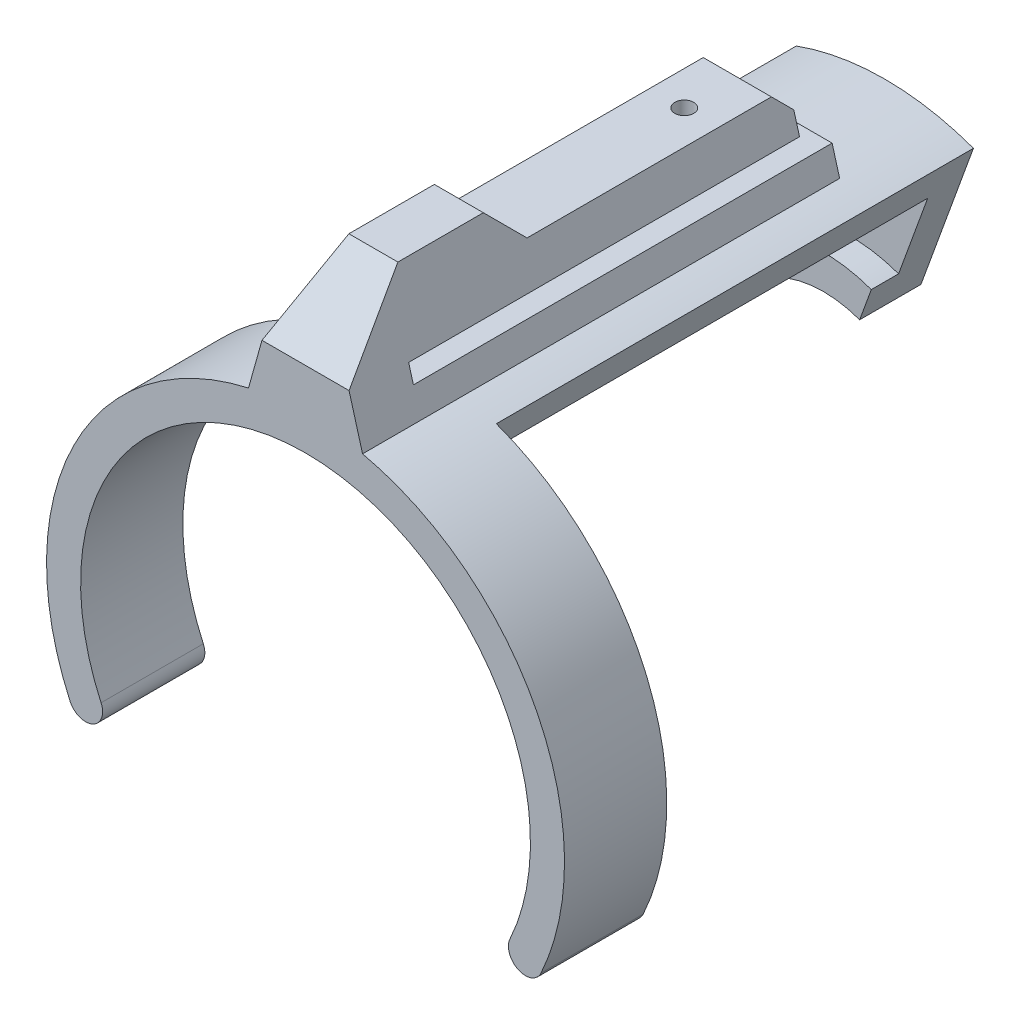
ISO-10303-21;
HEADER;
FILE_DESCRIPTION(('STEP AP214'),'2;1');
FILE_NAME('part.step','',(''),(''),'','','');
FILE_SCHEMA(('AUTOMOTIVE_DESIGN { 1 0 10303 214 1 1 1 1 }'));
ENDSEC;
DATA;
#1=APPLICATION_CONTEXT('core data for automotive mechanical design processes');
#2=APPLICATION_PROTOCOL_DEFINITION('international standard','automotive_design',2000,#1);
#3=PRODUCT_CONTEXT('',#1,'mechanical');
#4=PRODUCT('Part','Part','',(#3));
#5=PRODUCT_RELATED_PRODUCT_CATEGORY('part','',(#4));
#6=PRODUCT_DEFINITION_FORMATION('','',#4);
#7=PRODUCT_DEFINITION_CONTEXT('part definition',#1,'design');
#8=PRODUCT_DEFINITION('design','',#6,#7);
#9=PRODUCT_DEFINITION_SHAPE('','',#8);
#10=(LENGTH_UNIT() NAMED_UNIT(*) SI_UNIT(.MILLI.,.METRE.));
#11=(NAMED_UNIT(*) PLANE_ANGLE_UNIT() SI_UNIT($,.RADIAN.));
#12=(NAMED_UNIT(*) SI_UNIT($,.STERADIAN.) SOLID_ANGLE_UNIT());
#13=UNCERTAINTY_MEASURE_WITH_UNIT(LENGTH_MEASURE(1.E-05),#10,'distance_accuracy_value','');
#14=(GEOMETRIC_REPRESENTATION_CONTEXT(3) GLOBAL_UNCERTAINTY_ASSIGNED_CONTEXT((#13)) GLOBAL_UNIT_ASSIGNED_CONTEXT((#10,
#11,#12)) REPRESENTATION_CONTEXT('',''));
#15=CARTESIAN_POINT('',(0.,0.,0.));
#16=DIRECTION('',(0.,0.,1.));
#17=DIRECTION('',(1.,0.,0.));
#18=AXIS2_PLACEMENT_3D('',#15,#16,#17);
#19=CARTESIAN_POINT('',(-5.,49.0673507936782,-55.));
#20=DIRECTION('',(0.,-1.,0.));
#21=DIRECTION('',(0.,0.,-1.));
#22=AXIS2_PLACEMENT_3D('',#19,#20,#21);
#23=PLANE('',#22);
#24=CARTESIAN_POINT('',(0.,49.0673507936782,-40.5675951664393));
#25=DIRECTION('',(0.,1.,0.));
#26=DIRECTION('',(0.,0.,1.));
#27=AXIS2_PLACEMENT_3D('',#24,#25,#26);
#28=CIRCLE('',#27,1.4);
#29=CARTESIAN_POINT('',(0.,49.0673507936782,-39.1675951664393));
#30=VERTEX_POINT('',#29);
#31=EDGE_CURVE('E240',#30,#30,#28,.T.);
#32=ORIENTED_EDGE('',*,*,#31,.F.);
#33=EDGE_LOOP('',(#32));
#34=FACE_BOUND('',#33,.T.);
#35=DIRECTION('',(-1.,0.,0.));
#36=VECTOR('',#35,1.);
#37=CARTESIAN_POINT('',(34.7913742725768,49.0673507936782,-12.5028492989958));
#38=LINE('',#37,#36);
#39=CARTESIAN_POINT('',(5.,49.0673507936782,-12.5028492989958));
#40=VERTEX_POINT('',#39);
#41=CARTESIAN_POINT('',(-5.,49.0673507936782,-12.5028492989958));
#42=VERTEX_POINT('',#41);
#43=EDGE_CURVE('E57',#40,#42,#38,.T.);
#44=ORIENTED_EDGE('',*,*,#43,.F.);
#45=DIRECTION('',(0.,0.,1.));
#46=VECTOR('',#45,1.);
#47=CARTESIAN_POINT('',(5.,49.0673507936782,-55.));
#48=LINE('',#47,#46);
#49=CARTESIAN_POINT('',(5.,49.0673507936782,-48.3523226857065));
#50=VERTEX_POINT('',#49);
#51=EDGE_CURVE('E290',#50,#40,#48,.T.);
#52=ORIENTED_EDGE('',*,*,#51,.F.);
#53=DIRECTION('',(-1.,0.,0.));
#54=VECTOR('',#53,1.);
#55=CARTESIAN_POINT('',(-5.,49.0673507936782,-48.3523226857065));
#56=LINE('',#55,#54);
#57=CARTESIAN_POINT('',(-5.,49.0673507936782,-48.3523226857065));
#58=VERTEX_POINT('',#57);
#59=EDGE_CURVE('E259',#50,#58,#56,.T.);
#60=ORIENTED_EDGE('',*,*,#59,.T.);
#61=DIRECTION('',(0.,0.,1.));
#62=VECTOR('',#61,1.);
#63=CARTESIAN_POINT('',(-5.,49.0673507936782,-55.));
#64=LINE('',#63,#62);
#65=EDGE_CURVE('E53',#58,#42,#64,.T.);
#66=ORIENTED_EDGE('',*,*,#65,.T.);
#67=EDGE_LOOP('',(#44,#52,#60,#66));
#68=FACE_BOUND('',#67,.T.);
#69=ADVANCED_FACE('F33',(#34,#68),#23,.F.);
#70=CARTESIAN_POINT('',(0.,0.,15.));
#71=DIRECTION('',(0.,0.,-1.));
#72=DIRECTION('',(-1.,0.,0.));
#73=AXIS2_PLACEMENT_3D('',#70,#71,#72);
#74=CYLINDRICAL_SURFACE('',#73,33.);
#75=CARTESIAN_POINT('',(0.,0.,0.));
#76=DIRECTION('',(0.,0.,-1.));
#77=DIRECTION('',(-1.,0.,0.));
#78=AXIS2_PLACEMENT_3D('',#75,#76,#77);
#79=CIRCLE('',#78,33.);
#80=CARTESIAN_POINT('',(-30.,-13.7477270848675,0.));
#81=VERTEX_POINT('',#80);
#82=CARTESIAN_POINT('',(-11.2866647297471,31.009856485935,0.));
#83=VERTEX_POINT('',#82);
#84=EDGE_CURVE('E362',#81,#83,#79,.T.);
#85=ORIENTED_EDGE('',*,*,#84,.T.);
#86=DIRECTION('',(0.,0.,-1.));
#87=VECTOR('',#86,1.);
#88=CARTESIAN_POINT('',(-11.2866647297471,31.009856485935,-65.));
#89=LINE('',#88,#87);
#90=CARTESIAN_POINT('',(-11.2866647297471,31.009856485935,-65.));
#91=VERTEX_POINT('',#90);
#92=EDGE_CURVE('E293',#83,#91,#89,.T.);
#93=ORIENTED_EDGE('',*,*,#92,.T.);
#94=CARTESIAN_POINT('',(0.,0.,-65.));
#95=DIRECTION('',(0.,0.,1.));
#96=DIRECTION('',(1.,0.,0.));
#97=AXIS2_PLACEMENT_3D('',#94,#95,#96);
#98=CIRCLE('',#97,33.);
#99=CARTESIAN_POINT('',(11.2866647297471,31.009856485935,-65.));
#100=VERTEX_POINT('',#99);
#101=EDGE_CURVE('E332',#100,#91,#98,.T.);
#102=ORIENTED_EDGE('',*,*,#101,.F.);
#103=DIRECTION('',(0.,0.,-1.));
#104=VECTOR('',#103,1.);
#105=CARTESIAN_POINT('',(11.2866647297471,31.009856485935,-65.));
#106=LINE('',#105,#104);
#107=CARTESIAN_POINT('',(11.2866647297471,31.009856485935,0.));
#108=VERTEX_POINT('',#107);
#109=EDGE_CURVE('E313',#108,#100,#106,.T.);
#110=ORIENTED_EDGE('',*,*,#109,.F.);
#111=CARTESIAN_POINT('',(30.,-13.7477270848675,0.));
#112=VERTEX_POINT('',#111);
#113=EDGE_CURVE('E361',#108,#112,#79,.T.);
#114=ORIENTED_EDGE('',*,*,#113,.T.);
#115=DIRECTION('',(0.,0.,-1.));
#116=VECTOR('',#115,1.);
#117=CARTESIAN_POINT('',(30.,-13.7477270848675,15.));
#118=LINE('',#117,#116);
#119=CARTESIAN_POINT('',(30.,-13.7477270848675,15.));
#120=VERTEX_POINT('',#119);
#121=EDGE_CURVE('E375',#120,#112,#118,.T.);
#122=ORIENTED_EDGE('',*,*,#121,.F.);
#123=CARTESIAN_POINT('',(0.,0.,15.));
#124=DIRECTION('',(0.,0.,-1.));
#125=DIRECTION('',(-1.,0.,0.));
#126=AXIS2_PLACEMENT_3D('',#123,#124,#125);
#127=CIRCLE('',#126,33.);
#128=CARTESIAN_POINT('',(-30.,-13.7477270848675,15.));
#129=VERTEX_POINT('',#128);
#130=EDGE_CURVE('E349',#129,#120,#127,.T.);
#131=ORIENTED_EDGE('',*,*,#130,.F.);
#132=DIRECTION('',(0.,0.,-1.));
#133=VECTOR('',#132,1.);
#134=CARTESIAN_POINT('',(-30.,-13.7477270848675,15.));
#135=LINE('',#134,#133);
#136=EDGE_CURVE('E378',#129,#81,#135,.T.);
#137=ORIENTED_EDGE('',*,*,#136,.T.);
#138=EDGE_LOOP('',(#85,#93,#102,#110,#114,#122,#131,#137));
#139=FACE_BOUND('',#138,.T.);
#140=CARTESIAN_POINT('',(0.,33.,-43.5675951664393));
#141=CARTESIAN_POINT('',(0.168138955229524,32.9999982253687,-43.5675878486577));
#142=CARTESIAN_POINT('',(0.33639094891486,32.998701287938,-43.5534122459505));
#143=CARTESIAN_POINT('',(0.668235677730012,32.9936522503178,-43.4970739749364));
#144=CARTESIAN_POINT('',(0.831822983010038,32.9898974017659,-43.4548799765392));
#145=CARTESIAN_POINT('',(1.14948445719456,32.9803566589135,-43.3437387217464));
#146=CARTESIAN_POINT('',(1.30356410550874,32.9745719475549,-43.2748070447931));
#147=CARTESIAN_POINT('',(1.59793078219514,32.9616193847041,-43.1121760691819));
#148=CARTESIAN_POINT('',(1.73822066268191,32.9544518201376,-43.0184819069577));
#149=CARTESIAN_POINT('',(2.00148223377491,32.9395131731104,-42.8086826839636));
#150=CARTESIAN_POINT('',(2.12440675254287,32.9317405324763,-42.6925185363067));
#151=CARTESIAN_POINT('',(2.34904315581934,32.91648074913,-42.4412022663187));
#152=CARTESIAN_POINT('',(2.45075408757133,32.908993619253,-42.3060492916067));
#153=CARTESIAN_POINT('',(2.63023932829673,32.8951362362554,-42.0203016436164));
#154=CARTESIAN_POINT('',(2.70797159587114,32.8887679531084,-41.8696804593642));
#155=CARTESIAN_POINT('',(2.8370244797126,32.8778878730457,-41.5574563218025));
#156=CARTESIAN_POINT('',(2.88834564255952,32.8733760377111,-41.3958535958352));
#157=CARTESIAN_POINT('',(2.96298122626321,32.8667332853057,-41.0667304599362));
#158=CARTESIAN_POINT('',(2.98637317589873,32.8645957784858,-40.8992277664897));
#159=CARTESIAN_POINT('',(3.00472589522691,32.862923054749,-40.5626610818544));
#160=CARTESIAN_POINT('',(2.99968729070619,32.8633877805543,-40.3935971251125));
#161=CARTESIAN_POINT('',(2.96138592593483,32.8668610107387,-40.0592396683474));
#162=CARTESIAN_POINT('',(2.9282075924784,32.8698619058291,-39.8939364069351));
#163=CARTESIAN_POINT('',(2.83469983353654,32.8780574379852,-39.5712545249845));
#164=CARTESIAN_POINT('',(2.7743700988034,32.8832521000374,-39.4138759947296));
#165=CARTESIAN_POINT('',(2.62817812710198,32.8952586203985,-39.111242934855));
#166=CARTESIAN_POINT('',(2.54227819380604,32.9020728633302,-38.9660067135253));
#167=CARTESIAN_POINT('',(2.34741134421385,32.9165486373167,-38.6919812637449));
#168=CARTESIAN_POINT('',(2.23844387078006,32.9242101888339,-38.5631924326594));
#169=CARTESIAN_POINT('',(2.00006245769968,32.9395511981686,-38.325226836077));
#170=CARTESIAN_POINT('',(1.87057556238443,32.9472306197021,-38.2161231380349));
#171=CARTESIAN_POINT('',(1.59508496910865,32.9617156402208,-38.0211904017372));
#172=CARTESIAN_POINT('',(1.44908125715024,32.9685212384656,-37.935361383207));
#173=CARTESIAN_POINT('',(1.14465269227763,32.980493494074,-37.7894182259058));
#174=CARTESIAN_POINT('',(0.986226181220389,32.9856599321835,-37.729307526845));
#175=CARTESIAN_POINT('',(0.661471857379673,32.9937693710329,-37.6365595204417));
#176=CARTESIAN_POINT('',(0.495144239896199,32.9967124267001,-37.6039215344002));
#177=CARTESIAN_POINT('',(0.159942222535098,33.0000364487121,-37.5671375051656));
#178=CARTESIAN_POINT('',(-0.00892102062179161,33.0004264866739,-37.5628905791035));
#179=CARTESIAN_POINT('',(-0.344956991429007,32.9986247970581,-37.5827446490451));
#180=CARTESIAN_POINT('',(-0.512129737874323,32.9964330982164,-37.6068453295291));
#181=CARTESIAN_POINT('',(-0.839750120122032,32.98972015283,-37.6826268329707));
#182=CARTESIAN_POINT('',(-1.00020870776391,32.985202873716,-37.7342606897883));
#183=CARTESIAN_POINT('',(-1.31018569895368,32.9743459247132,-37.8635947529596));
#184=CARTESIAN_POINT('',(-1.45970389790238,32.9680062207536,-37.9412954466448));
#185=CARTESIAN_POINT('',(-1.74401365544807,32.9541918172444,-38.1208096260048));
#186=CARTESIAN_POINT('',(-1.87876301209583,32.9467140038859,-38.2226897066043));
#187=CARTESIAN_POINT('',(-2.129283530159,32.9314733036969,-38.4475747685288));
#188=CARTESIAN_POINT('',(-2.24505429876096,32.92371041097,-38.5705801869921));
#189=CARTESIAN_POINT('',(-2.45467921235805,32.9087474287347,-38.8346630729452));
#190=CARTESIAN_POINT('',(-2.54846736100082,32.9015490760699,-38.9757930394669));
#191=CARTESIAN_POINT('',(-2.71101171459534,32.8885556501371,-39.2718585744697));
#192=CARTESIAN_POINT('',(-2.77976820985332,32.8827605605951,-39.4267939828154));
#193=CARTESIAN_POINT('',(-2.89018592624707,32.8732400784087,-39.7458418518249));
#194=CARTESIAN_POINT('',(-2.93188705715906,32.8695116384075,-39.909940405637));
#195=CARTESIAN_POINT('',(-2.98714005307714,32.8645367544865,-40.2428456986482));
#196=CARTESIAN_POINT('',(-3.00069257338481,32.8632902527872,-40.4116523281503));
#197=CARTESIAN_POINT('',(-2.99925542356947,32.8634213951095,-40.7485260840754));
#198=CARTESIAN_POINT('',(-2.9843694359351,32.8647895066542,-40.9165936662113));
#199=CARTESIAN_POINT('',(-2.92669454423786,32.8699754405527,-41.2478306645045));
#200=CARTESIAN_POINT('',(-2.88390560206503,32.8737932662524,-41.4110000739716));
#201=CARTESIAN_POINT('',(-2.77166673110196,32.8834458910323,-41.7278123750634));
#202=CARTESIAN_POINT('',(-2.70221919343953,32.8892805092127,-41.8814561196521));
#203=CARTESIAN_POINT('',(-2.53864562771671,32.9023096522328,-42.1749216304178));
#204=CARTESIAN_POINT('',(-2.4445198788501,32.9095041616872,-42.3147435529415));
#205=CARTESIAN_POINT('',(-2.23387195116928,32.9244737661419,-42.5771275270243));
#206=CARTESIAN_POINT('',(-2.11727272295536,32.9322508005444,-42.6996276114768));
#207=CARTESIAN_POINT('',(-1.8651341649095,32.9474914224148,-42.9233723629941));
#208=CARTESIAN_POINT('',(-1.72959027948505,32.9549549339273,-43.0246119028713));
#209=CARTESIAN_POINT('',(-1.44310097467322,32.9687436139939,-43.2031249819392));
#210=CARTESIAN_POINT('',(-1.29212319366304,32.9750663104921,-43.2803467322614));
#211=CARTESIAN_POINT('',(-0.979386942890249,32.9858330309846,-43.4082427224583));
#212=CARTESIAN_POINT('',(-0.817641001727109,32.9902791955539,-43.4589472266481));
#213=CARTESIAN_POINT('',(-0.545797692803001,32.9956609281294,-43.5195724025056));
#214=CARTESIAN_POINT('',(-0.437444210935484,32.9972805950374,-43.5375567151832));
#215=CARTESIAN_POINT('',(-0.219409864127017,32.9994507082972,-43.5615704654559));
#216=CARTESIAN_POINT('',(-0.109729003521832,33.0000011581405,-43.5675999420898));
#217=CARTESIAN_POINT('',(0.,33.,-43.5675951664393));
#218=B_SPLINE_CURVE_WITH_KNOTS('',3,(#140,#141,#142,#143,#144,#145,#146,#147,#148,#149,#150,
#151,#152,#153,#154,#155,#156,#157,#158,#159,#160,#161,#162,#163,#164,#165,#166,#167,#168,#169,
#170,#171,#172,#173,#174,#175,#176,#177,#178,#179,#180,#181,#182,#183,#184,#185,#186,#187,#188,
#189,#190,#191,#192,#193,#194,#195,#196,#197,#198,#199,#200,#201,#202,#203,#204,#205,#206,#207,
#208,#209,#210,#211,#212,#213,#214,#215,#216,#217),.UNSPECIFIED.,.T.,.F.,(4,2,2,2,2,2,2,2,2,2,2,
2,2,2,2,2,2,2,2,2,2,2,2,2,2,2,2,2,2,2,2,2,2,2,2,2,2,2,4),(0.,0.504016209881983,1.00859696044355,
1.51288414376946,2.01706680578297,2.52259374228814,3.02814337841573,3.53457441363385,
4.04099496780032,4.54600645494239,5.0510068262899,5.55449739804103,6.05799370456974,
6.56223598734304,7.0664904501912,7.57257974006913,8.07866945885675,8.58482684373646,
9.09097172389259,9.59531714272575,10.0996569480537,10.6031391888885,11.1066308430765,
11.6115256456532,12.1164308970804,12.6228330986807,13.1292294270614,13.6348770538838,
14.1405129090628,14.6443088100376,15.1481053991,15.6518568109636,16.1556025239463,
16.6611070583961,17.1667333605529,17.6734424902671,18.1795720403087,18.5084986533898,
18.8374241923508),.UNSPECIFIED.);
#219=CARTESIAN_POINT('',(0.,33.,-43.5675951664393));
#220=VERTEX_POINT('',#219);
#221=EDGE_CURVE('E37',#220,#220,#218,.T.);
#222=ORIENTED_EDGE('',*,*,#221,.F.);
#223=EDGE_LOOP('',(#222));
#224=FACE_BOUND('',#223,.T.);
#225=ADVANCED_FACE('F409',(#139,#224),#74,.F.);
#226=CARTESIAN_POINT('',(0.,0.,15.));
#227=DIRECTION('',(0.,0.,-1.));
#228=DIRECTION('',(-1.,0.,0.));
#229=AXIS2_PLACEMENT_3D('',#226,#227,#228);
#230=CYLINDRICAL_SURFACE('',#229,38.);
#231=DIRECTION('',(0.,0.,1.));
#232=VECTOR('',#231,1.);
#233=CARTESIAN_POINT('',(8.36728780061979,37.0673507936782,-55.));
#234=LINE('',#233,#232);
#235=CARTESIAN_POINT('',(8.36728780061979,37.0673507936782,-55.));
#236=VERTEX_POINT('',#235);
#237=CARTESIAN_POINT('',(8.36728780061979,37.0673507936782,15.));
#238=VERTEX_POINT('',#237);
#239=EDGE_CURVE('E287',#236,#238,#234,.T.);
#240=ORIENTED_EDGE('',*,*,#239,.T.);
#241=CARTESIAN_POINT('',(0.,0.,15.));
#242=DIRECTION('',(0.,0.,1.));
#243=DIRECTION('',(-1.,0.,0.));
#244=AXIS2_PLACEMENT_3D('',#241,#242,#243);
#245=CIRCLE('',#244,38.);
#246=CARTESIAN_POINT('',(34.5454545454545,-15.8307160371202,15.));
#247=VERTEX_POINT('',#246);
#248=EDGE_CURVE('E355',#247,#238,#245,.T.);
#249=ORIENTED_EDGE('',*,*,#248,.F.);
#250=DIRECTION('',(0.,0.,-1.));
#251=VECTOR('',#250,1.);
#252=CARTESIAN_POINT('',(34.5454545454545,-15.8307160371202,15.));
#253=LINE('',#252,#251);
#254=CARTESIAN_POINT('',(34.5454545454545,-15.8307160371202,0.));
#255=VERTEX_POINT('',#254);
#256=EDGE_CURVE('E372',#247,#255,#253,.T.);
#257=ORIENTED_EDGE('',*,*,#256,.T.);
#258=CARTESIAN_POINT('',(0.,0.,0.));
#259=DIRECTION('',(0.,0.,1.));
#260=DIRECTION('',(-1.,0.,0.));
#261=AXIS2_PLACEMENT_3D('',#258,#259,#260);
#262=CIRCLE('',#261,38.);
#263=CARTESIAN_POINT('',(12.9967654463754,35.7083195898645,0.));
#264=VERTEX_POINT('',#263);
#265=EDGE_CURVE('E350',#255,#264,#262,.T.);
#266=ORIENTED_EDGE('',*,*,#265,.T.);
#267=DIRECTION('',(0.,0.,1.));
#268=VECTOR('',#267,1.);
#269=CARTESIAN_POINT('',(12.9967654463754,35.7083195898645,15.));
#270=LINE('',#269,#268);
#271=CARTESIAN_POINT('',(12.9967654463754,35.7083195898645,-70.));
#272=VERTEX_POINT('',#271);
#273=EDGE_CURVE('E330',#272,#264,#270,.T.);
#274=ORIENTED_EDGE('',*,*,#273,.F.);
#275=CARTESIAN_POINT('',(0.,0.,-70.));
#276=DIRECTION('',(0.,0.,1.));
#277=DIRECTION('',(1.,0.,0.));
#278=AXIS2_PLACEMENT_3D('',#275,#276,#277);
#279=CIRCLE('',#278,38.);
#280=CARTESIAN_POINT('',(-12.9967654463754,35.7083195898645,-70.));
#281=VERTEX_POINT('',#280);
#282=EDGE_CURVE('E343',#272,#281,#279,.T.);
#283=ORIENTED_EDGE('',*,*,#282,.T.);
#284=DIRECTION('',(0.,0.,1.));
#285=VECTOR('',#284,1.);
#286=CARTESIAN_POINT('',(-12.9967654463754,35.7083195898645,15.));
#287=LINE('',#286,#285);
#288=CARTESIAN_POINT('',(-12.9967654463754,35.7083195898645,0.));
#289=VERTEX_POINT('',#288);
#290=EDGE_CURVE('E310',#281,#289,#287,.T.);
#291=ORIENTED_EDGE('',*,*,#290,.T.);
#292=CARTESIAN_POINT('',(-34.5454545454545,-15.8307160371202,0.));
#293=VERTEX_POINT('',#292);
#294=EDGE_CURVE('E367',#289,#293,#262,.T.);
#295=ORIENTED_EDGE('',*,*,#294,.T.);
#296=DIRECTION('',(0.,0.,-1.));
#297=VECTOR('',#296,1.);
#298=CARTESIAN_POINT('',(-34.5454545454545,-15.8307160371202,15.));
#299=LINE('',#298,#297);
#300=CARTESIAN_POINT('',(-34.5454545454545,-15.8307160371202,15.));
#301=VERTEX_POINT('',#300);
#302=EDGE_CURVE('E358',#301,#293,#299,.T.);
#303=ORIENTED_EDGE('',*,*,#302,.F.);
#304=CARTESIAN_POINT('',(-8.36728780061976,37.0673507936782,15.));
#305=VERTEX_POINT('',#304);
#306=EDGE_CURVE('E354',#305,#301,#245,.T.);
#307=ORIENTED_EDGE('',*,*,#306,.F.);
#308=DIRECTION('',(0.,0.,1.));
#309=VECTOR('',#308,1.);
#310=CARTESIAN_POINT('',(-8.36728780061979,37.0673507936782,-55.));
#311=LINE('',#310,#309);
#312=CARTESIAN_POINT('',(-8.36728780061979,37.0673507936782,-55.));
#313=VERTEX_POINT('',#312);
#314=EDGE_CURVE('E283',#313,#305,#311,.T.);
#315=ORIENTED_EDGE('',*,*,#314,.F.);
#316=CARTESIAN_POINT('',(0.,0.,-55.));
#317=DIRECTION('',(0.,0.,-1.));
#318=DIRECTION('',(-1.,0.,0.));
#319=AXIS2_PLACEMENT_3D('',#316,#317,#318);
#320=CIRCLE('',#319,38.);
#321=EDGE_CURVE('E386',#313,#236,#320,.T.);
#322=ORIENTED_EDGE('',*,*,#321,.T.);
#323=EDGE_LOOP('',(#240,#249,#257,#266,#274,#283,#291,#295,#303,#307,#315,#322));
#324=FACE_BOUND('',#323,.T.);
#325=ADVANCED_FACE('F411',(#324),#230,.T.);
#326=CARTESIAN_POINT('',(-16.1363636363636,-7.39461078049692,0.));
#327=DIRECTION('',(0.,0.,1.));
#328=DIRECTION('',(1.,0.,0.));
#329=AXIS2_PLACEMENT_3D('',#326,#327,#328);
#330=PLANE('',#329);
#331=DIRECTION('',(-0.34202014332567,-0.939692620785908,0.));
#332=VECTOR('',#331,1.);
#333=CARTESIAN_POINT('',(-4.26417806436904,-11.7157329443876,0.));
#334=LINE('',#333,#332);
#335=EDGE_CURVE('E384',#264,#108,#334,.T.);
#336=ORIENTED_EDGE('',*,*,#335,.F.);
#337=ORIENTED_EDGE('',*,*,#265,.F.);
#338=CARTESIAN_POINT('',(32.2727272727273,-14.7892215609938,0.));
#339=DIRECTION('',(0.,0.,1.));
#340=DIRECTION('',(-1.,0.,0.));
#341=AXIS2_PLACEMENT_3D('',#338,#339,#340);
#342=CIRCLE('',#341,2.5);
#343=EDGE_CURVE('E365',#112,#255,#342,.T.);
#344=ORIENTED_EDGE('',*,*,#343,.F.);
#345=ORIENTED_EDGE('',*,*,#113,.F.);
#346=EDGE_LOOP('',(#336,#337,#344,#345));
#347=FACE_BOUND('',#346,.T.);
#348=ADVANCED_FACE('F417',(#347),#330,.F.);
#349=CARTESIAN_POINT('',(-32.2727272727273,-14.7892215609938,15.));
#350=DIRECTION('',(0.,0.,-1.));
#351=DIRECTION('',(-1.,0.,0.));
#352=AXIS2_PLACEMENT_3D('',#349,#350,#351);
#353=CYLINDRICAL_SURFACE('',#352,2.5);
#354=CARTESIAN_POINT('',(-32.2727272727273,-14.7892215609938,0.));
#355=DIRECTION('',(0.,0.,1.));
#356=DIRECTION('',(1.,0.,0.));
#357=AXIS2_PLACEMENT_3D('',#354,#355,#356);
#358=CIRCLE('',#357,2.5);
#359=EDGE_CURVE('E345',#293,#81,#358,.T.);
#360=ORIENTED_EDGE('',*,*,#359,.T.);
#361=ORIENTED_EDGE('',*,*,#136,.F.);
#362=CARTESIAN_POINT('',(-32.2727272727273,-14.7892215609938,15.));
#363=DIRECTION('',(0.,0.,1.));
#364=DIRECTION('',(1.,0.,0.));
#365=AXIS2_PLACEMENT_3D('',#362,#363,#364);
#366=CIRCLE('',#365,2.5);
#367=EDGE_CURVE('E346',#301,#129,#366,.T.);
#368=ORIENTED_EDGE('',*,*,#367,.F.);
#369=ORIENTED_EDGE('',*,*,#302,.T.);
#370=EDGE_LOOP('',(#360,#361,#368,#369));
#371=FACE_BOUND('',#370,.T.);
#372=ADVANCED_FACE('F35',(#371),#353,.T.);
#373=CARTESIAN_POINT('',(32.2727272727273,-14.7892215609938,15.));
#374=DIRECTION('',(0.,0.,-1.));
#375=DIRECTION('',(-1.,0.,0.));
#376=AXIS2_PLACEMENT_3D('',#373,#374,#375);
#377=CYLINDRICAL_SURFACE('',#376,2.5);
#378=ORIENTED_EDGE('',*,*,#343,.T.);
#379=ORIENTED_EDGE('',*,*,#256,.F.);
#380=CARTESIAN_POINT('',(32.2727272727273,-14.7892215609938,15.));
#381=DIRECTION('',(0.,0.,1.));
#382=DIRECTION('',(-1.,0.,0.));
#383=AXIS2_PLACEMENT_3D('',#380,#381,#382);
#384=CIRCLE('',#383,2.5);
#385=EDGE_CURVE('E352',#120,#247,#384,.T.);
#386=ORIENTED_EDGE('',*,*,#385,.F.);
#387=ORIENTED_EDGE('',*,*,#121,.T.);
#388=EDGE_LOOP('',(#378,#379,#386,#387));
#389=FACE_BOUND('',#388,.T.);
#390=ADVANCED_FACE('F424',(#389),#377,.T.);
#391=CARTESIAN_POINT('',(-16.1363636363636,-7.39461078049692,15.));
#392=DIRECTION('',(0.,0.,1.));
#393=DIRECTION('',(1.,0.,0.));
#394=AXIS2_PLACEMENT_3D('',#391,#392,#393);
#395=PLANE('',#394);
#396=DIRECTION('',(1.,0.,0.));
#397=VECTOR('',#396,1.);
#398=CARTESIAN_POINT('',(-16.1363636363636,44.1185070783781,15.));
#399=LINE('',#398,#397);
#400=CARTESIAN_POINT('',(-6.38868175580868,44.1185070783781,15.));
#401=VERTEX_POINT('',#400);
#402=CARTESIAN_POINT('',(6.38868175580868,44.1185070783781,15.));
#403=VERTEX_POINT('',#402);
#404=EDGE_CURVE('E211',#401,#403,#399,.T.);
#405=ORIENTED_EDGE('',*,*,#404,.F.);
#406=DIRECTION('',(0.270172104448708,0.962812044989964,0.));
#407=VECTOR('',#406,1.);
#408=CARTESIAN_POINT('',(-8.36728780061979,37.0673507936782,15.));
#409=LINE('',#408,#407);
#410=EDGE_CURVE('E207',#305,#401,#409,.T.);
#411=ORIENTED_EDGE('',*,*,#410,.F.);
#412=ORIENTED_EDGE('',*,*,#306,.T.);
#413=ORIENTED_EDGE('',*,*,#367,.T.);
#414=ORIENTED_EDGE('',*,*,#130,.T.);
#415=ORIENTED_EDGE('',*,*,#385,.T.);
#416=ORIENTED_EDGE('',*,*,#248,.T.);
#417=DIRECTION('',(0.270172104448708,-0.962812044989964,0.));
#418=VECTOR('',#417,1.);
#419=CARTESIAN_POINT('',(8.36728780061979,37.0673507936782,15.));
#420=LINE('',#419,#418);
#421=EDGE_CURVE('E281',#403,#238,#420,.T.);
#422=ORIENTED_EDGE('',*,*,#421,.F.);
#423=EDGE_LOOP('',(#405,#411,#412,#413,#414,#415,#416,#422));
#424=FACE_BOUND('',#423,.T.);
#425=ADVANCED_FACE('F426',(#424),#395,.T.);
#426=ORIENTED_EDGE('',*,*,#294,.F.);
#427=DIRECTION('',(0.342020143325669,-0.939692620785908,0.));
#428=VECTOR('',#427,1.);
#429=CARTESIAN_POINT('',(0.4889861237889,-1.34347833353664,0.));
#430=LINE('',#429,#428);
#431=EDGE_CURVE('E381',#289,#83,#430,.T.);
#432=ORIENTED_EDGE('',*,*,#431,.T.);
#433=ORIENTED_EDGE('',*,*,#84,.F.);
#434=ORIENTED_EDGE('',*,*,#359,.F.);
#435=EDGE_LOOP('',(#426,#432,#433,#434));
#436=FACE_BOUND('',#435,.T.);
#437=ADVANCED_FACE('F429',(#436),#330,.F.);
#438=CARTESIAN_POINT('',(0.,0.,0.));
#439=DIRECTION('',(-0.939692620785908,0.342020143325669,0.));
#440=DIRECTION('',(0.,0.,1.));
#441=AXIS2_PLACEMENT_3D('',#438,#439,#440);
#442=PLANE('',#441);
#443=ORIENTED_EDGE('',*,*,#273,.T.);
#444=ORIENTED_EDGE('',*,*,#335,.T.);
#445=ORIENTED_EDGE('',*,*,#109,.T.);
#446=DIRECTION('',(-0.342020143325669,-0.939692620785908,0.));
#447=VECTOR('',#446,1.);
#448=CARTESIAN_POINT('',(7.01141293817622,19.2636987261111,-65.));
#449=LINE('',#448,#447);
#450=CARTESIAN_POINT('',(7.01141293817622,19.2636987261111,-65.));
#451=VERTEX_POINT('',#450);
#452=EDGE_CURVE('E315',#100,#451,#449,.T.);
#453=ORIENTED_EDGE('',*,*,#452,.T.);
#454=DIRECTION('',(0.,0.,1.));
#455=VECTOR('',#454,1.);
#456=CARTESIAN_POINT('',(7.01141293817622,19.2636987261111,-61.));
#457=LINE('',#456,#455);
#458=CARTESIAN_POINT('',(7.01141293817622,19.2636987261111,-61.));
#459=VERTEX_POINT('',#458);
#460=EDGE_CURVE('E318',#451,#459,#457,.T.);
#461=ORIENTED_EDGE('',*,*,#460,.T.);
#462=DIRECTION('',(-0.342020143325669,-0.939692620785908,0.));
#463=VECTOR('',#462,1.);
#464=CARTESIAN_POINT('',(5.30131222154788,14.5652356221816,-61.));
#465=LINE('',#464,#463);
#466=CARTESIAN_POINT('',(5.30131222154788,14.5652356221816,-61.));
#467=VERTEX_POINT('',#466);
#468=EDGE_CURVE('E321',#459,#467,#465,.T.);
#469=ORIENTED_EDGE('',*,*,#468,.T.);
#470=DIRECTION('',(0.,0.,-1.));
#471=VECTOR('',#470,1.);
#472=CARTESIAN_POINT('',(5.30131222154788,14.5652356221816,-70.));
#473=LINE('',#472,#471);
#474=CARTESIAN_POINT('',(5.30131222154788,14.5652356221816,-70.));
#475=VERTEX_POINT('',#474);
#476=EDGE_CURVE('E324',#467,#475,#473,.T.);
#477=ORIENTED_EDGE('',*,*,#476,.T.);
#478=DIRECTION('',(0.342020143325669,0.939692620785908,0.));
#479=VECTOR('',#478,1.);
#480=CARTESIAN_POINT('',(12.9967654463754,35.7083195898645,-70.));
#481=LINE('',#480,#479);
#482=EDGE_CURVE('E327',#475,#272,#481,.T.);
#483=ORIENTED_EDGE('',*,*,#482,.T.);
#484=EDGE_LOOP('',(#443,#444,#445,#453,#461,#469,#477,#483));
#485=FACE_BOUND('',#484,.T.);
#486=ADVANCED_FACE('F432',(#485),#442,.F.);
#487=CARTESIAN_POINT('',(0.,0.,0.));
#488=DIRECTION('',(-0.939692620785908,-0.342020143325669,0.));
#489=DIRECTION('',(0.,0.,1.));
#490=AXIS2_PLACEMENT_3D('',#487,#488,#489);
#491=PLANE('',#490);
#492=ORIENTED_EDGE('',*,*,#431,.F.);
#493=ORIENTED_EDGE('',*,*,#290,.F.);
#494=DIRECTION('',(-0.342020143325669,0.939692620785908,0.));
#495=VECTOR('',#494,1.);
#496=CARTESIAN_POINT('',(-12.9967654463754,35.7083195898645,-70.));
#497=LINE('',#496,#495);
#498=CARTESIAN_POINT('',(-5.30131222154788,14.5652356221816,-70.));
#499=VERTEX_POINT('',#498);
#500=EDGE_CURVE('E307',#499,#281,#497,.T.);
#501=ORIENTED_EDGE('',*,*,#500,.F.);
#502=DIRECTION('',(0.,0.,-1.));
#503=VECTOR('',#502,1.);
#504=CARTESIAN_POINT('',(-5.30131222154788,14.5652356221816,-70.));
#505=LINE('',#504,#503);
#506=CARTESIAN_POINT('',(-5.30131222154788,14.5652356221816,-61.));
#507=VERTEX_POINT('',#506);
#508=EDGE_CURVE('E304',#507,#499,#505,.T.);
#509=ORIENTED_EDGE('',*,*,#508,.F.);
#510=DIRECTION('',(0.342020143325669,-0.939692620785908,0.));
#511=VECTOR('',#510,1.);
#512=CARTESIAN_POINT('',(-5.30131222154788,14.5652356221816,-61.));
#513=LINE('',#512,#511);
#514=CARTESIAN_POINT('',(-7.01141293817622,19.2636987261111,-61.));
#515=VERTEX_POINT('',#514);
#516=EDGE_CURVE('E301',#515,#507,#513,.T.);
#517=ORIENTED_EDGE('',*,*,#516,.F.);
#518=DIRECTION('',(0.,0.,1.));
#519=VECTOR('',#518,1.);
#520=CARTESIAN_POINT('',(-7.01141293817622,19.2636987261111,-61.));
#521=LINE('',#520,#519);
#522=CARTESIAN_POINT('',(-7.01141293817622,19.2636987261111,-65.));
#523=VERTEX_POINT('',#522);
#524=EDGE_CURVE('E298',#523,#515,#521,.T.);
#525=ORIENTED_EDGE('',*,*,#524,.F.);
#526=DIRECTION('',(0.342020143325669,-0.939692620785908,0.));
#527=VECTOR('',#526,1.);
#528=CARTESIAN_POINT('',(-7.01141293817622,19.2636987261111,-65.));
#529=LINE('',#528,#527);
#530=EDGE_CURVE('E295',#91,#523,#529,.T.);
#531=ORIENTED_EDGE('',*,*,#530,.F.);
#532=ORIENTED_EDGE('',*,*,#92,.F.);
#533=EDGE_LOOP('',(#492,#493,#501,#509,#517,#525,#531,#532));
#534=FACE_BOUND('',#533,.T.);
#535=ADVANCED_FACE('F441',(#534),#491,.T.);
#536=CARTESIAN_POINT('',(12.9967654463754,35.7083195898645,-70.));
#537=DIRECTION('',(0.,0.,1.));
#538=DIRECTION('',(1.,0.,0.));
#539=AXIS2_PLACEMENT_3D('',#536,#537,#538);
#540=PLANE('',#539);
#541=CARTESIAN_POINT('',(0.,0.,-70.));
#542=DIRECTION('',(0.,0.,1.));
#543=DIRECTION('',(1.,0.,0.));
#544=AXIS2_PLACEMENT_3D('',#541,#542,#543);
#545=CIRCLE('',#544,15.5);
#546=EDGE_CURVE('E341',#475,#499,#545,.T.);
#547=ORIENTED_EDGE('',*,*,#546,.T.);
#548=ORIENTED_EDGE('',*,*,#500,.T.);
#549=ORIENTED_EDGE('',*,*,#282,.F.);
#550=ORIENTED_EDGE('',*,*,#482,.F.);
#551=EDGE_LOOP('',(#547,#548,#549,#550));
#552=FACE_BOUND('',#551,.T.);
#553=ADVANCED_FACE('F437',(#552),#540,.F.);
#554=CARTESIAN_POINT('',(0.,0.,0.));
#555=DIRECTION('',(0.,0.,1.));
#556=DIRECTION('',(1.,0.,0.));
#557=AXIS2_PLACEMENT_3D('',#554,#555,#556);
#558=CYLINDRICAL_SURFACE('',#557,15.5);
#559=CARTESIAN_POINT('',(0.,0.,-61.));
#560=DIRECTION('',(0.,0.,1.));
#561=DIRECTION('',(1.,0.,0.));
#562=AXIS2_PLACEMENT_3D('',#559,#560,#561);
#563=CIRCLE('',#562,15.5);
#564=EDGE_CURVE('E339',#467,#507,#563,.T.);
#565=ORIENTED_EDGE('',*,*,#564,.T.);
#566=ORIENTED_EDGE('',*,*,#508,.T.);
#567=ORIENTED_EDGE('',*,*,#546,.F.);
#568=ORIENTED_EDGE('',*,*,#476,.F.);
#569=EDGE_LOOP('',(#565,#566,#567,#568));
#570=FACE_BOUND('',#569,.T.);
#571=ADVANCED_FACE('F440',(#570),#558,.F.);
#572=CARTESIAN_POINT('',(5.30131222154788,14.5652356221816,-61.));
#573=DIRECTION('',(0.,0.,-1.));
#574=DIRECTION('',(-1.,0.,0.));
#575=AXIS2_PLACEMENT_3D('',#572,#573,#574);
#576=PLANE('',#575);
#577=CARTESIAN_POINT('',(0.,0.,-61.));
#578=DIRECTION('',(0.,0.,1.));
#579=DIRECTION('',(1.,0.,0.));
#580=AXIS2_PLACEMENT_3D('',#577,#578,#579);
#581=CIRCLE('',#580,20.5);
#582=EDGE_CURVE('E337',#459,#515,#581,.T.);
#583=ORIENTED_EDGE('',*,*,#582,.T.);
#584=ORIENTED_EDGE('',*,*,#516,.T.);
#585=ORIENTED_EDGE('',*,*,#564,.F.);
#586=ORIENTED_EDGE('',*,*,#468,.F.);
#587=EDGE_LOOP('',(#583,#584,#585,#586));
#588=FACE_BOUND('',#587,.T.);
#589=ADVANCED_FACE('F445',(#588),#576,.F.);
#590=CARTESIAN_POINT('',(0.,0.,0.));
#591=DIRECTION('',(0.,0.,1.));
#592=DIRECTION('',(1.,0.,0.));
#593=AXIS2_PLACEMENT_3D('',#590,#591,#592);
#594=CYLINDRICAL_SURFACE('',#593,20.5);
#595=CARTESIAN_POINT('',(0.,0.,-65.));
#596=DIRECTION('',(0.,0.,1.));
#597=DIRECTION('',(1.,0.,0.));
#598=AXIS2_PLACEMENT_3D('',#595,#596,#597);
#599=CIRCLE('',#598,20.5);
#600=EDGE_CURVE('E335',#451,#523,#599,.T.);
#601=ORIENTED_EDGE('',*,*,#600,.T.);
#602=ORIENTED_EDGE('',*,*,#524,.T.);
#603=ORIENTED_EDGE('',*,*,#582,.F.);
#604=ORIENTED_EDGE('',*,*,#460,.F.);
#605=EDGE_LOOP('',(#601,#602,#603,#604));
#606=FACE_BOUND('',#605,.T.);
#607=ADVANCED_FACE('F449',(#606),#594,.T.);
#608=CARTESIAN_POINT('',(7.01141293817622,19.2636987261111,-65.));
#609=DIRECTION('',(0.,0.,-1.));
#610=DIRECTION('',(-1.,0.,0.));
#611=AXIS2_PLACEMENT_3D('',#608,#609,#610);
#612=PLANE('',#611);
#613=ORIENTED_EDGE('',*,*,#101,.T.);
#614=ORIENTED_EDGE('',*,*,#530,.T.);
#615=ORIENTED_EDGE('',*,*,#600,.F.);
#616=ORIENTED_EDGE('',*,*,#452,.F.);
#617=EDGE_LOOP('',(#613,#614,#615,#616));
#618=FACE_BOUND('',#617,.T.);
#619=ADVANCED_FACE('F453',(#618),#612,.F.);
#620=CARTESIAN_POINT('',(0.,0.,-55.));
#621=DIRECTION('',(0.,0.,-1.));
#622=DIRECTION('',(-1.,0.,0.));
#623=AXIS2_PLACEMENT_3D('',#620,#621,#622);
#624=PLANE('',#623);
#625=DIRECTION('',(-1.,0.,0.));
#626=VECTOR('',#625,1.);
#627=CARTESIAN_POINT('',(0.,41.,-55.));
#628=LINE('',#627,#626);
#629=CARTESIAN_POINT('',(7.26375765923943,41.,-55.));
#630=VERTEX_POINT('',#629);
#631=CARTESIAN_POINT('',(-7.26375765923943,41.,-55.));
#632=VERTEX_POINT('',#631);
#633=EDGE_CURVE('E272',#630,#632,#628,.T.);
#634=ORIENTED_EDGE('',*,*,#633,.F.);
#635=DIRECTION('',(0.270172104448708,-0.962812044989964,0.));
#636=VECTOR('',#635,1.);
#637=CARTESIAN_POINT('',(8.36728780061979,37.0673507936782,-55.));
#638=LINE('',#637,#636);
#639=EDGE_CURVE('E280',#630,#236,#638,.T.);
#640=ORIENTED_EDGE('',*,*,#639,.T.);
#641=ORIENTED_EDGE('',*,*,#321,.F.);
#642=DIRECTION('',(0.270172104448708,0.962812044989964,0.));
#643=VECTOR('',#642,1.);
#644=CARTESIAN_POINT('',(-8.36728780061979,37.0673507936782,-55.));
#645=LINE('',#644,#643);
#646=EDGE_CURVE('E277',#313,#632,#645,.T.);
#647=ORIENTED_EDGE('',*,*,#646,.T.);
#648=EDGE_LOOP('',(#634,#640,#641,#647));
#649=FACE_BOUND('',#648,.T.);
#650=ADVANCED_FACE('F457',(#649),#624,.T.);
#651=CARTESIAN_POINT('',(-8.36728780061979,37.0673507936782,-55.));
#652=DIRECTION('',(0.962812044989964,-0.270172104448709,0.));
#653=DIRECTION('',(0.270172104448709,0.962812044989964,0.));
#654=AXIS2_PLACEMENT_3D('',#651,#652,#653);
#655=PLANE('',#654);
#656=DIRECTION('',(0.194625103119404,0.693585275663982,-0.69358527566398));
#657=VECTOR('',#656,1.);
#658=CARTESIAN_POINT('',(2.03377888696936,74.1336212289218,-15.0151141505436));
#659=LINE('',#658,#657);
#660=CARTESIAN_POINT('',(-3.59482497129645,54.0749715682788,5.04353551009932));
#661=VERTEX_POINT('',#660);
#662=EDGE_CURVE('E199',#401,#661,#659,.T.);
#663=ORIENTED_EDGE('',*,*,#662,.T.);
#664=DIRECTION('',(0.,0.,-1.));
#665=VECTOR('',#664,1.);
#666=CARTESIAN_POINT('',(-3.59482497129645,54.0749715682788,5.04353551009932));
#667=LINE('',#666,#665);
#668=CARTESIAN_POINT('',(-3.59482497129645,54.0749715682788,-7.49522852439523));
#669=VERTEX_POINT('',#668);
#670=EDGE_CURVE('E204',#661,#669,#667,.T.);
#671=ORIENTED_EDGE('',*,*,#670,.T.);
#672=DIRECTION('',(-0.194625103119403,-0.69358527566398,-0.693585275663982));
#673=VECTOR('',#672,1.);
#674=CARTESIAN_POINT('',(-4.7765169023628,49.8637772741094,-11.7064228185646));
#675=LINE('',#674,#673);
#676=EDGE_CURVE('E225',#669,#42,#675,.T.);
#677=ORIENTED_EDGE('',*,*,#676,.T.);
#678=ORIENTED_EDGE('',*,*,#65,.F.);
#679=DIRECTION('',(-0.194625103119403,-0.693585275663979,-0.693585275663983));
#680=VECTOR('',#679,1.);
#681=CARTESIAN_POINT('',(-7.64478254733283,39.6421420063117,-57.7775314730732));
#682=LINE('',#681,#680);
#683=CARTESIAN_POINT('',(-5.7204174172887,46.5,-50.9196734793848));
#684=VERTEX_POINT('',#683);
#685=EDGE_CURVE('E261',#58,#684,#682,.T.);
#686=ORIENTED_EDGE('',*,*,#685,.T.);
#687=DIRECTION('',(-0.270172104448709,-0.962812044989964,0.));
#688=VECTOR('',#687,1.);
#689=CARTESIAN_POINT('',(-8.36728780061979,37.0673507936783,-50.9196734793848));
#690=LINE('',#689,#688);
#691=CARTESIAN_POINT('',(-6.56223936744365,43.5,-50.9196734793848));
#692=VERTEX_POINT('',#691);
#693=EDGE_CURVE('E264',#684,#692,#690,.T.);
#694=ORIENTED_EDGE('',*,*,#693,.T.);
#695=DIRECTION('',(0.,0.,1.));
#696=VECTOR('',#695,1.);
#697=CARTESIAN_POINT('',(-6.56223936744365,43.5,-55.));
#698=LINE('',#697,#696);
#699=CARTESIAN_POINT('',(-6.56223936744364,43.5,6.43240483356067));
#700=VERTEX_POINT('',#699);
#701=EDGE_CURVE('E267',#692,#700,#698,.T.);
#702=ORIENTED_EDGE('',*,*,#701,.T.);
#703=DIRECTION('',(-0.270172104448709,-0.962812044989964,0.));
#704=VECTOR('',#703,1.);
#705=CARTESIAN_POINT('',(-8.3672878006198,37.0673507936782,6.43240483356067));
#706=LINE('',#705,#704);
#707=CARTESIAN_POINT('',(-7.26375765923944,41.,6.43240483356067));
#708=VERTEX_POINT('',#707);
#709=EDGE_CURVE('E269',#700,#708,#706,.T.);
#710=ORIENTED_EDGE('',*,*,#709,.T.);
#711=DIRECTION('',(0.,0.,-1.));
#712=VECTOR('',#711,1.);
#713=CARTESIAN_POINT('',(-7.26375765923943,41.,-55.));
#714=LINE('',#713,#712);
#715=EDGE_CURVE('E274',#708,#632,#714,.T.);
#716=ORIENTED_EDGE('',*,*,#715,.T.);
#717=ORIENTED_EDGE('',*,*,#646,.F.);
#718=ORIENTED_EDGE('',*,*,#314,.T.);
#719=ORIENTED_EDGE('',*,*,#410,.T.);
#720=EDGE_LOOP('',(#663,#671,#677,#678,#686,#694,#702,#710,#716,#717,#718,#719));
#721=FACE_BOUND('',#720,.T.);
#722=ADVANCED_FACE('F201',(#721),#655,.F.);
#723=CARTESIAN_POINT('',(8.36728780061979,37.0673507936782,-55.));
#724=DIRECTION('',(-0.962812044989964,-0.270172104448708,0.));
#725=DIRECTION('',(0.270172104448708,-0.962812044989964,0.));
#726=AXIS2_PLACEMENT_3D('',#723,#724,#725);
#727=PLANE('',#726);
#728=DIRECTION('',(0.194625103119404,-0.693585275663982,0.69358527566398));
#729=VECTOR('',#728,1.);
#730=CARTESIAN_POINT('',(-2.03377888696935,74.1336212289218,-15.0151141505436));
#731=LINE('',#730,#729);
#732=CARTESIAN_POINT('',(3.59482497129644,54.0749715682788,5.04353551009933));
#733=VERTEX_POINT('',#732);
#734=EDGE_CURVE('E217',#733,#403,#731,.T.);
#735=ORIENTED_EDGE('',*,*,#734,.T.);
#736=ORIENTED_EDGE('',*,*,#421,.T.);
#737=ORIENTED_EDGE('',*,*,#239,.F.);
#738=ORIENTED_EDGE('',*,*,#639,.F.);
#739=DIRECTION('',(0.,0.,1.));
#740=VECTOR('',#739,1.);
#741=CARTESIAN_POINT('',(7.26375765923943,41.,-55.));
#742=LINE('',#741,#740);
#743=CARTESIAN_POINT('',(7.26375765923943,41.,6.43240483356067));
#744=VERTEX_POINT('',#743);
#745=EDGE_CURVE('E11',#630,#744,#742,.T.);
#746=ORIENTED_EDGE('',*,*,#745,.T.);
#747=DIRECTION('',(-0.270172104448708,0.962812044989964,0.));
#748=VECTOR('',#747,1.);
#749=CARTESIAN_POINT('',(8.3672878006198,37.0673507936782,6.43240483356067));
#750=LINE('',#749,#748);
#751=CARTESIAN_POINT('',(6.56223936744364,43.5,6.43240483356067));
#752=VERTEX_POINT('',#751);
#753=EDGE_CURVE('E45',#744,#752,#750,.T.);
#754=ORIENTED_EDGE('',*,*,#753,.T.);
#755=DIRECTION('',(0.,0.,-1.));
#756=VECTOR('',#755,1.);
#757=CARTESIAN_POINT('',(6.56223936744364,43.5,-55.));
#758=LINE('',#757,#756);
#759=CARTESIAN_POINT('',(6.56223936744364,43.5,-50.9196734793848));
#760=VERTEX_POINT('',#759);
#761=EDGE_CURVE('E396',#752,#760,#758,.T.);
#762=ORIENTED_EDGE('',*,*,#761,.T.);
#763=DIRECTION('',(-0.270172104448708,0.962812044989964,0.));
#764=VECTOR('',#763,1.);
#765=CARTESIAN_POINT('',(8.36728780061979,37.0673507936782,-50.9196734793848));
#766=LINE('',#765,#764);
#767=CARTESIAN_POINT('',(5.7204174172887,46.5,-50.9196734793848));
#768=VERTEX_POINT('',#767);
#769=EDGE_CURVE('E393',#760,#768,#766,.T.);
#770=ORIENTED_EDGE('',*,*,#769,.T.);
#771=DIRECTION('',(-0.194625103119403,0.693585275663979,0.693585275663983));
#772=VECTOR('',#771,1.);
#773=CARTESIAN_POINT('',(7.64478254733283,39.6421420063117,-57.7775314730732));
#774=LINE('',#773,#772);
#775=EDGE_CURVE('E390',#768,#50,#774,.T.);
#776=ORIENTED_EDGE('',*,*,#775,.T.);
#777=ORIENTED_EDGE('',*,*,#51,.T.);
#778=DIRECTION('',(0.194625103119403,-0.69358527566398,-0.693585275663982));
#779=VECTOR('',#778,1.);
#780=CARTESIAN_POINT('',(4.7765169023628,49.8637772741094,-11.7064228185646));
#781=LINE('',#780,#779);
#782=CARTESIAN_POINT('',(3.59482497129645,54.0749715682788,-7.49522852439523));
#783=VERTEX_POINT('',#782);
#784=EDGE_CURVE('E231',#783,#40,#781,.T.);
#785=ORIENTED_EDGE('',*,*,#784,.F.);
#786=DIRECTION('',(0.,0.,-1.));
#787=VECTOR('',#786,1.);
#788=CARTESIAN_POINT('',(3.59482497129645,54.0749715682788,5.04353551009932));
#789=LINE('',#788,#787);
#790=EDGE_CURVE('E229',#733,#783,#789,.T.);
#791=ORIENTED_EDGE('',*,*,#790,.F.);
#792=EDGE_LOOP('',(#735,#736,#737,#738,#746,#754,#762,#770,#776,#777,#785,#791));
#793=FACE_BOUND('',#792,.T.);
#794=ADVANCED_FACE('F466',(#793),#727,.F.);
#795=CARTESIAN_POINT('',(-38.,50.0608129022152,9.05769417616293));
#796=DIRECTION('',(0.,-0.707106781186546,-0.707106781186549));
#797=DIRECTION('',(0.,0.707106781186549,-0.707106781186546));
#798=AXIS2_PLACEMENT_3D('',#795,#796,#797);
#799=PLANE('',#798);
#800=DIRECTION('',(-1.,0.,0.));
#801=VECTOR('',#800,1.);
#802=CARTESIAN_POINT('',(34.7913742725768,54.0749715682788,5.04353551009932));
#803=LINE('',#802,#801);
#804=EDGE_CURVE('E215',#733,#661,#803,.T.);
#805=ORIENTED_EDGE('',*,*,#804,.T.);
#806=ORIENTED_EDGE('',*,*,#662,.F.);
#807=ORIENTED_EDGE('',*,*,#404,.T.);
#808=ORIENTED_EDGE('',*,*,#734,.F.);
#809=EDGE_LOOP('',(#805,#806,#807,#808));
#810=FACE_BOUND('',#809,.T.);
#811=ADVANCED_FACE('F216',(#810),#799,.F.);
#812=CARTESIAN_POINT('',(-38.,41.,-70.2600550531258));
#813=DIRECTION('',(0.,-1.,0.));
#814=DIRECTION('',(0.,0.,-1.));
#815=AXIS2_PLACEMENT_3D('',#812,#813,#814);
#816=PLANE('',#815);
#817=CARTESIAN_POINT('',(0.,41.,-40.5675951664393));
#818=DIRECTION('',(0.,-1.,0.));
#819=DIRECTION('',(0.,0.,-1.));
#820=AXIS2_PLACEMENT_3D('',#817,#818,#819);
#821=CIRCLE('',#820,1.4);
#822=CARTESIAN_POINT('',(0.,41.,-41.9675951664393));
#823=VERTEX_POINT('',#822);
#824=EDGE_CURVE('E244',#823,#823,#821,.T.);
#825=ORIENTED_EDGE('',*,*,#824,.T.);
#826=EDGE_LOOP('',(#825));
#827=FACE_BOUND('',#826,.T.);
#828=DIRECTION('',(1.,0.,0.));
#829=VECTOR('',#828,1.);
#830=CARTESIAN_POINT('',(-38.,41.,6.43240483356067));
#831=LINE('',#830,#829);
#832=EDGE_CURVE('E212',#708,#744,#831,.T.);
#833=ORIENTED_EDGE('',*,*,#832,.T.);
#834=ORIENTED_EDGE('',*,*,#745,.F.);
#835=ORIENTED_EDGE('',*,*,#633,.T.);
#836=ORIENTED_EDGE('',*,*,#715,.F.);
#837=EDGE_LOOP('',(#833,#834,#835,#836));
#838=FACE_BOUND('',#837,.T.);
#839=ADVANCED_FACE('F476',(#827,#838),#816,.F.);
#840=CARTESIAN_POINT('',(-38.,41.,6.43240483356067));
#841=DIRECTION('',(0.,0.,1.));
#842=DIRECTION('',(0.,-1.,0.));
#843=AXIS2_PLACEMENT_3D('',#840,#841,#842);
#844=PLANE('',#843);
#845=DIRECTION('',(1.,0.,0.));
#846=VECTOR('',#845,1.);
#847=CARTESIAN_POINT('',(-38.,43.5,6.43240483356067));
#848=LINE('',#847,#846);
#849=EDGE_CURVE('E250',#700,#752,#848,.T.);
#850=ORIENTED_EDGE('',*,*,#849,.T.);
#851=ORIENTED_EDGE('',*,*,#753,.F.);
#852=ORIENTED_EDGE('',*,*,#832,.F.);
#853=ORIENTED_EDGE('',*,*,#709,.F.);
#854=EDGE_LOOP('',(#850,#851,#852,#853));
#855=FACE_BOUND('',#854,.T.);
#856=ADVANCED_FACE('F489',(#855),#844,.F.);
#857=CARTESIAN_POINT('',(-38.,43.5,6.43240483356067));
#858=DIRECTION('',(0.,1.,0.));
#859=DIRECTION('',(0.,0.,1.));
#860=AXIS2_PLACEMENT_3D('',#857,#858,#859);
#861=PLANE('',#860);
#862=CARTESIAN_POINT('',(0.,43.5,-40.5675951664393));
#863=DIRECTION('',(0.,1.,0.));
#864=DIRECTION('',(0.,0.,1.));
#865=AXIS2_PLACEMENT_3D('',#862,#863,#864);
#866=CIRCLE('',#865,1.4);
#867=CARTESIAN_POINT('',(0.,43.5,-39.1675951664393));
#868=VERTEX_POINT('',#867);
#869=EDGE_CURVE('E243',#868,#868,#866,.T.);
#870=ORIENTED_EDGE('',*,*,#869,.T.);
#871=EDGE_LOOP('',(#870));
#872=FACE_BOUND('',#871,.T.);
#873=DIRECTION('',(1.,0.,0.));
#874=VECTOR('',#873,1.);
#875=CARTESIAN_POINT('',(-38.,43.5,-50.9196734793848));
#876=LINE('',#875,#874);
#877=EDGE_CURVE('E253',#692,#760,#876,.T.);
#878=ORIENTED_EDGE('',*,*,#877,.T.);
#879=ORIENTED_EDGE('',*,*,#761,.F.);
#880=ORIENTED_EDGE('',*,*,#849,.F.);
#881=ORIENTED_EDGE('',*,*,#701,.F.);
#882=EDGE_LOOP('',(#878,#879,#880,#881));
#883=FACE_BOUND('',#882,.T.);
#884=ADVANCED_FACE('F485',(#872,#883),#861,.F.);
#885=CARTESIAN_POINT('',(-38.,43.5,-50.9196734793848));
#886=DIRECTION('',(0.,0.,1.));
#887=DIRECTION('',(0.,-1.,0.));
#888=AXIS2_PLACEMENT_3D('',#885,#886,#887);
#889=PLANE('',#888);
#890=DIRECTION('',(1.,0.,0.));
#891=VECTOR('',#890,1.);
#892=CARTESIAN_POINT('',(-38.,46.5,-50.9196734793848));
#893=LINE('',#892,#891);
#894=EDGE_CURVE('E247',#684,#768,#893,.T.);
#895=ORIENTED_EDGE('',*,*,#894,.T.);
#896=ORIENTED_EDGE('',*,*,#769,.F.);
#897=ORIENTED_EDGE('',*,*,#877,.F.);
#898=ORIENTED_EDGE('',*,*,#693,.F.);
#899=EDGE_LOOP('',(#895,#896,#897,#898));
#900=FACE_BOUND('',#899,.T.);
#901=ADVANCED_FACE('F481',(#900),#889,.F.);
#902=CARTESIAN_POINT('',(-38.,46.5,-50.9196734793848));
#903=DIRECTION('',(0.,-0.70710678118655,0.707106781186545));
#904=DIRECTION('',(0.,-0.707106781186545,-0.70710678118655));
#905=AXIS2_PLACEMENT_3D('',#902,#903,#904);
#906=PLANE('',#905);
#907=ORIENTED_EDGE('',*,*,#59,.F.);
#908=ORIENTED_EDGE('',*,*,#775,.F.);
#909=ORIENTED_EDGE('',*,*,#894,.F.);
#910=ORIENTED_EDGE('',*,*,#685,.F.);
#911=EDGE_LOOP('',(#907,#908,#909,#910));
#912=FACE_BOUND('',#911,.T.);
#913=ADVANCED_FACE('F477',(#912),#906,.F.);
#914=CARTESIAN_POINT('',(0.,-15.9326492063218,-40.5675951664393));
#915=DIRECTION('',(0.,1.,0.));
#916=DIRECTION('',(0.,0.,1.));
#917=AXIS2_PLACEMENT_3D('',#914,#915,#916);
#918=CYLINDRICAL_SURFACE('',#917,1.4);
#919=ORIENTED_EDGE('',*,*,#31,.T.);
#920=EDGE_LOOP('',(#919));
#921=FACE_BOUND('',#920,.T.);
#922=ORIENTED_EDGE('',*,*,#869,.F.);
#923=EDGE_LOOP('',(#922));
#924=FACE_BOUND('',#923,.T.);
#925=ADVANCED_FACE('F480',(#921,#924),#918,.F.);
#926=CARTESIAN_POINT('',(0.,35.009856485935,-40.5675951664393));
#927=DIRECTION('',(0.,1.,0.));
#928=DIRECTION('',(0.,0.,1.));
#929=AXIS2_PLACEMENT_3D('',#926,#927,#928);
#930=CIRCLE('',#929,1.4);
#931=CARTESIAN_POINT('',(0.,35.009856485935,-39.1675951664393));
#932=VERTEX_POINT('',#931);
#933=EDGE_CURVE('E239',#932,#932,#930,.F.);
#934=ORIENTED_EDGE('',*,*,#933,.T.);
#935=EDGE_LOOP('',(#934));
#936=FACE_BOUND('',#935,.T.);
#937=ORIENTED_EDGE('',*,*,#824,.F.);
#938=EDGE_LOOP('',(#937));
#939=FACE_BOUND('',#938,.T.);
#940=ADVANCED_FACE('F497',(#936,#939),#918,.F.);
#941=CARTESIAN_POINT('',(0.,35.009856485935,-40.5675951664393));
#942=DIRECTION('',(0.,-1.,0.));
#943=DIRECTION('',(0.,0.,-1.));
#944=AXIS2_PLACEMENT_3D('',#941,#942,#943);
#945=CYLINDRICAL_SURFACE('',#944,3.);
#946=CARTESIAN_POINT('',(0.,35.009856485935,-40.5675951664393));
#947=DIRECTION('',(0.,1.,0.));
#948=DIRECTION('',(0.,0.,1.));
#949=AXIS2_PLACEMENT_3D('',#946,#947,#948);
#950=CIRCLE('',#949,3.);
#951=CARTESIAN_POINT('',(0.,35.009856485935,-37.5675951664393));
#952=VERTEX_POINT('',#951);
#953=EDGE_CURVE('E233',#952,#952,#950,.T.);
#954=ORIENTED_EDGE('',*,*,#953,.T.);
#955=EDGE_LOOP('',(#954));
#956=FACE_BOUND('',#955,.T.);
#957=ORIENTED_EDGE('',*,*,#221,.T.);
#958=EDGE_LOOP('',(#957));
#959=FACE_BOUND('',#958,.T.);
#960=ADVANCED_FACE('F407',(#956,#959),#945,.F.);
#961=CARTESIAN_POINT('',(0.,35.009856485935,-40.5675951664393));
#962=DIRECTION('',(0.,1.,0.));
#963=DIRECTION('',(0.,0.,1.));
#964=AXIS2_PLACEMENT_3D('',#961,#962,#963);
#965=PLANE('',#964);
#966=ORIENTED_EDGE('',*,*,#953,.F.);
#967=EDGE_LOOP('',(#966));
#968=FACE_BOUND('',#967,.T.);
#969=ORIENTED_EDGE('',*,*,#933,.F.);
#970=EDGE_LOOP('',(#969));
#971=FACE_BOUND('',#970,.T.);
#972=ADVANCED_FACE('F502',(#968,#971),#965,.F.);
#973=CARTESIAN_POINT('',(34.7913742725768,54.0749715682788,5.04353551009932));
#974=DIRECTION('',(0.,-1.,0.));
#975=DIRECTION('',(0.,0.,-1.));
#976=AXIS2_PLACEMENT_3D('',#973,#974,#975);
#977=PLANE('',#976);
#978=ORIENTED_EDGE('',*,*,#804,.F.);
#979=ORIENTED_EDGE('',*,*,#790,.T.);
#980=DIRECTION('',(-1.,0.,0.));
#981=VECTOR('',#980,1.);
#982=CARTESIAN_POINT('',(34.7913742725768,54.0749715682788,-7.49522852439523));
#983=LINE('',#982,#981);
#984=EDGE_CURVE('E221',#783,#669,#983,.T.);
#985=ORIENTED_EDGE('',*,*,#984,.T.);
#986=ORIENTED_EDGE('',*,*,#670,.F.);
#987=EDGE_LOOP('',(#978,#979,#985,#986));
#988=FACE_BOUND('',#987,.T.);
#989=ADVANCED_FACE('F223',(#988),#977,.F.);
#990=CARTESIAN_POINT('',(34.7913742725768,54.0749715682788,-7.49522852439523));
#991=DIRECTION('',(0.,-0.707106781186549,0.707106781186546));
#992=DIRECTION('',(0.,-0.707106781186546,-0.707106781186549));
#993=AXIS2_PLACEMENT_3D('',#990,#991,#992);
#994=PLANE('',#993);
#995=ORIENTED_EDGE('',*,*,#984,.F.);
#996=ORIENTED_EDGE('',*,*,#784,.T.);
#997=ORIENTED_EDGE('',*,*,#43,.T.);
#998=ORIENTED_EDGE('',*,*,#676,.F.);
#999=EDGE_LOOP('',(#995,#996,#997,#998));
#1000=FACE_BOUND('',#999,.T.);
#1001=ADVANCED_FACE('F507',(#1000),#994,.F.);
#1002=CLOSED_SHELL('',(#69,#225,#325,#348,#372,#390,#425,#437,#486,#535,#553,#571,#589,#607,
#619,#650,#722,#794,#811,#839,#856,#884,#901,#913,#925,#940,#960,#972,#989,#1001));
#1003=MANIFOLD_SOLID_BREP('B2',#1002);
#1004=ADVANCED_BREP_SHAPE_REPRESENTATION('',(#18,#1003),#14);
#1005=SHAPE_DEFINITION_REPRESENTATION(#9,#1004);
ENDSEC;
END-ISO-10303-21;
